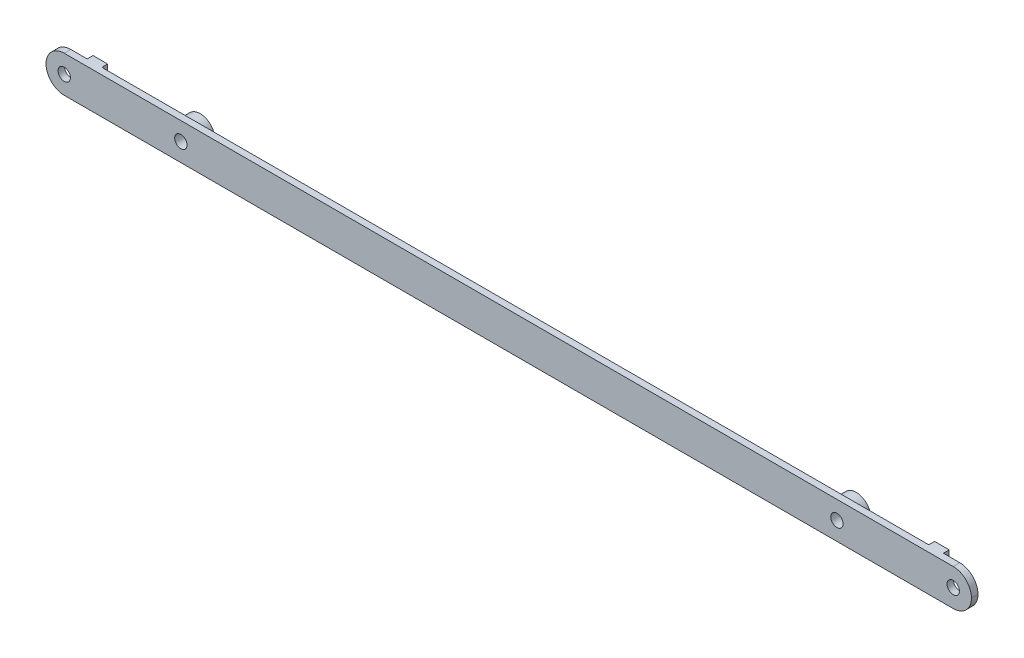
ISO-10303-21;
HEADER;
FILE_DESCRIPTION(('STEP AP214'),'2;1');
FILE_NAME('part.step','',(''),(''),'','','');
FILE_SCHEMA(('AUTOMOTIVE_DESIGN { 1 0 10303 214 1 1 1 1 }'));
ENDSEC;
DATA;
#1=APPLICATION_CONTEXT('core data for automotive mechanical design processes');
#2=APPLICATION_PROTOCOL_DEFINITION('international standard','automotive_design',2000,#1);
#3=PRODUCT_CONTEXT('',#1,'mechanical');
#4=PRODUCT('Part','Part','',(#3));
#5=PRODUCT_RELATED_PRODUCT_CATEGORY('part','',(#4));
#6=PRODUCT_DEFINITION_FORMATION('','',#4);
#7=PRODUCT_DEFINITION_CONTEXT('part definition',#1,'design');
#8=PRODUCT_DEFINITION('design','',#6,#7);
#9=PRODUCT_DEFINITION_SHAPE('','',#8);
#10=(LENGTH_UNIT() NAMED_UNIT(*) SI_UNIT(.MILLI.,.METRE.));
#11=(NAMED_UNIT(*) PLANE_ANGLE_UNIT() SI_UNIT($,.RADIAN.));
#12=(NAMED_UNIT(*) SI_UNIT($,.STERADIAN.) SOLID_ANGLE_UNIT());
#13=UNCERTAINTY_MEASURE_WITH_UNIT(LENGTH_MEASURE(1.E-05),#10,'distance_accuracy_value','');
#14=(GEOMETRIC_REPRESENTATION_CONTEXT(3) GLOBAL_UNCERTAINTY_ASSIGNED_CONTEXT((#13)) GLOBAL_UNIT_ASSIGNED_CONTEXT((#10,
#11,#12)) REPRESENTATION_CONTEXT('',''));
#15=CARTESIAN_POINT('',(0.,0.,0.));
#16=DIRECTION('',(0.,0.,1.));
#17=DIRECTION('',(1.,0.,0.));
#18=AXIS2_PLACEMENT_3D('',#15,#16,#17);
#19=CARTESIAN_POINT('',(0.,0.,0.));
#20=DIRECTION('',(0.,0.,-1.));
#21=DIRECTION('',(-1.,0.,0.));
#22=AXIS2_PLACEMENT_3D('',#19,#20,#21);
#23=PLANE('',#22);
#24=DIRECTION('',(0.,-1.,0.));
#25=VECTOR('',#24,1.);
#26=CARTESIAN_POINT('',(-87.2960224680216,4.27712700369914,0.));
#27=LINE('',#26,#25);
#28=CARTESIAN_POINT('',(-87.2960224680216,4.27712700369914,0.));
#29=VERTEX_POINT('',#28);
#30=CARTESIAN_POINT('',(-87.2960224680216,-5.72287299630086,0.));
#31=VERTEX_POINT('',#30);
#32=EDGE_CURVE('E172',#29,#31,#27,.T.);
#33=ORIENTED_EDGE('',*,*,#32,.T.);
#34=DIRECTION('',(1.,0.,0.));
#35=VECTOR('',#34,1.);
#36=CARTESIAN_POINT('',(-96.7960224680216,-5.72287299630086,0.));
#37=LINE('',#36,#35);
#38=CARTESIAN_POINT('',(-91.7960224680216,-5.72287299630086,0.));
#39=VERTEX_POINT('',#38);
#40=EDGE_CURVE('E152',#39,#31,#37,.T.);
#41=ORIENTED_EDGE('',*,*,#40,.F.);
#42=CARTESIAN_POINT('',(-91.7960224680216,-0.722872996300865,0.));
#43=DIRECTION('',(0.,0.,-1.));
#44=DIRECTION('',(-1.,0.,0.));
#45=AXIS2_PLACEMENT_3D('',#42,#43,#44);
#46=CIRCLE('',#45,5.);
#47=CARTESIAN_POINT('',(-96.7960224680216,-0.722872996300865,0.));
#48=VERTEX_POINT('',#47);
#49=EDGE_CURVE('E261',#39,#48,#46,.T.);
#50=ORIENTED_EDGE('',*,*,#49,.T.);
#51=CARTESIAN_POINT('',(-91.7960224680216,-0.722872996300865,0.));
#52=DIRECTION('',(0.,0.,-1.));
#53=DIRECTION('',(-1.,0.,0.));
#54=AXIS2_PLACEMENT_3D('',#51,#52,#53);
#55=CIRCLE('',#54,5.);
#56=CARTESIAN_POINT('',(-91.7960224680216,4.27712700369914,0.));
#57=VERTEX_POINT('',#56);
#58=EDGE_CURVE('E252',#48,#57,#55,.T.);
#59=ORIENTED_EDGE('',*,*,#58,.T.);
#60=DIRECTION('',(-1.,0.,0.));
#61=VECTOR('',#60,1.);
#62=CARTESIAN_POINT('',(-96.7960224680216,4.27712700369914,0.));
#63=LINE('',#62,#61);
#64=EDGE_CURVE('E254',#29,#57,#63,.T.);
#65=ORIENTED_EDGE('',*,*,#64,.F.);
#66=EDGE_LOOP('',(#33,#41,#50,#59,#65));
#67=FACE_BOUND('',#66,.T.);
#68=CARTESIAN_POINT('',(-91.7960224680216,-0.722872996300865,0.));
#69=DIRECTION('',(0.,0.,1.));
#70=DIRECTION('',(1.,0.,0.));
#71=AXIS2_PLACEMENT_3D('',#68,#69,#70);
#72=CIRCLE('',#71,1.69999999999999);
#73=CARTESIAN_POINT('',(-90.0960224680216,-0.722872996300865,0.));
#74=VERTEX_POINT('',#73);
#75=EDGE_CURVE('E234',#74,#74,#72,.T.);
#76=ORIENTED_EDGE('',*,*,#75,.T.);
#77=EDGE_LOOP('',(#76));
#78=FACE_BOUND('',#77,.T.);
#79=ADVANCED_FACE('F35',(#67,#78),#23,.T.);
#80=DIRECTION('',(0.,1.,0.));
#81=VECTOR('',#80,1.);
#82=CARTESIAN_POINT('',(147.603977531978,-5.72287299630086,0.));
#83=LINE('',#82,#81);
#84=CARTESIAN_POINT('',(147.603977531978,-5.72287299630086,0.));
#85=VERTEX_POINT('',#84);
#86=CARTESIAN_POINT('',(147.603977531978,4.27712700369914,0.));
#87=VERTEX_POINT('',#86);
#88=EDGE_CURVE('E179',#85,#87,#83,.T.);
#89=ORIENTED_EDGE('',*,*,#88,.T.);
#90=CARTESIAN_POINT('',(152.103977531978,4.27712700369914,0.));
#91=VERTEX_POINT('',#90);
#92=EDGE_CURVE('E249',#91,#87,#63,.T.);
#93=ORIENTED_EDGE('',*,*,#92,.F.);
#94=CARTESIAN_POINT('',(152.103977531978,-0.722872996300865,0.));
#95=DIRECTION('',(0.,0.,-1.));
#96=DIRECTION('',(-1.,0.,0.));
#97=AXIS2_PLACEMENT_3D('',#94,#95,#96);
#98=CIRCLE('',#97,5.);
#99=CARTESIAN_POINT('',(157.103977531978,-0.722872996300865,0.));
#100=VERTEX_POINT('',#99);
#101=EDGE_CURVE('E263',#91,#100,#98,.T.);
#102=ORIENTED_EDGE('',*,*,#101,.T.);
#103=CARTESIAN_POINT('',(152.103977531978,-0.722872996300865,0.));
#104=DIRECTION('',(0.,0.,-1.));
#105=DIRECTION('',(-1.,0.,0.));
#106=AXIS2_PLACEMENT_3D('',#103,#104,#105);
#107=CIRCLE('',#106,5.);
#108=CARTESIAN_POINT('',(152.103977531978,-5.72287299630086,0.));
#109=VERTEX_POINT('',#108);
#110=EDGE_CURVE('E265',#100,#109,#107,.T.);
#111=ORIENTED_EDGE('',*,*,#110,.T.);
#112=EDGE_CURVE('E242',#85,#109,#37,.T.);
#113=ORIENTED_EDGE('',*,*,#112,.F.);
#114=EDGE_LOOP('',(#89,#93,#102,#111,#113));
#115=FACE_BOUND('',#114,.T.);
#116=CARTESIAN_POINT('',(152.103977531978,-0.722872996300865,0.));
#117=DIRECTION('',(0.,0.,1.));
#118=DIRECTION('',(1.,0.,0.));
#119=AXIS2_PLACEMENT_3D('',#116,#117,#118);
#120=CIRCLE('',#119,1.70000000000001);
#121=CARTESIAN_POINT('',(153.803977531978,-0.722872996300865,0.));
#122=VERTEX_POINT('',#121);
#123=EDGE_CURVE('E235',#122,#122,#120,.T.);
#124=ORIENTED_EDGE('',*,*,#123,.T.);
#125=EDGE_LOOP('',(#124));
#126=FACE_BOUND('',#125,.T.);
#127=ADVANCED_FACE('F353',(#115,#126),#23,.T.);
#128=CARTESIAN_POINT('',(-59.7960224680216,-0.722872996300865,2.));
#129=DIRECTION('',(0.,0.,-1.));
#130=DIRECTION('',(-1.,0.,0.));
#131=AXIS2_PLACEMENT_3D('',#128,#129,#130);
#132=CYLINDRICAL_SURFACE('',#131,1.7);
#133=CARTESIAN_POINT('',(-59.7960224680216,-0.722872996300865,-2.04999999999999));
#134=DIRECTION('',(0.,0.,-1.));
#135=DIRECTION('',(-1.,0.,0.));
#136=AXIS2_PLACEMENT_3D('',#133,#134,#135);
#137=CIRCLE('',#136,1.69999999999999);
#138=CARTESIAN_POINT('',(-61.4960224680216,-0.722872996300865,-2.04999999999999));
#139=VERTEX_POINT('',#138);
#140=EDGE_CURVE('E209',#139,#139,#137,.T.);
#141=ORIENTED_EDGE('',*,*,#140,.T.);
#142=EDGE_LOOP('',(#141));
#143=FACE_BOUND('',#142,.T.);
#144=CARTESIAN_POINT('',(-59.7960224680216,-0.722872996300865,1.8));
#145=DIRECTION('',(0.,0.,-1.));
#146=DIRECTION('',(-1.,0.,0.));
#147=AXIS2_PLACEMENT_3D('',#144,#145,#146);
#148=CIRCLE('',#147,1.7);
#149=CARTESIAN_POINT('',(-61.4960224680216,-0.722872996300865,1.8));
#150=VERTEX_POINT('',#149);
#151=EDGE_CURVE('E227',#150,#150,#148,.F.);
#152=ORIENTED_EDGE('',*,*,#151,.T.);
#153=EDGE_LOOP('',(#152));
#154=FACE_BOUND('',#153,.T.);
#155=ADVANCED_FACE('F384',(#143,#154),#132,.F.);
#156=CARTESIAN_POINT('',(120.203977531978,-0.722872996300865,2.));
#157=DIRECTION('',(0.,0.,-1.));
#158=DIRECTION('',(-1.,0.,0.));
#159=AXIS2_PLACEMENT_3D('',#156,#157,#158);
#160=CYLINDRICAL_SURFACE('',#159,1.70000000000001);
#161=CARTESIAN_POINT('',(120.203977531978,-0.722872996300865,-2.04999999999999));
#162=DIRECTION('',(0.,0.,-1.));
#163=DIRECTION('',(-1.,0.,0.));
#164=AXIS2_PLACEMENT_3D('',#161,#162,#163);
#165=CIRCLE('',#164,1.69999999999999);
#166=CARTESIAN_POINT('',(118.503977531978,-0.722872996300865,-2.04999999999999));
#167=VERTEX_POINT('',#166);
#168=EDGE_CURVE('E215',#167,#167,#165,.T.);
#169=ORIENTED_EDGE('',*,*,#168,.T.);
#170=EDGE_LOOP('',(#169));
#171=FACE_BOUND('',#170,.T.);
#172=CARTESIAN_POINT('',(120.203977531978,-0.722872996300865,1.8));
#173=DIRECTION('',(0.,0.,-1.));
#174=DIRECTION('',(-1.,0.,0.));
#175=AXIS2_PLACEMENT_3D('',#172,#173,#174);
#176=CIRCLE('',#175,1.70000000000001);
#177=CARTESIAN_POINT('',(118.503977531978,-0.722872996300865,1.8));
#178=VERTEX_POINT('',#177);
#179=EDGE_CURVE('E224',#178,#178,#176,.F.);
#180=ORIENTED_EDGE('',*,*,#179,.T.);
#181=EDGE_LOOP('',(#180));
#182=FACE_BOUND('',#181,.T.);
#183=ADVANCED_FACE('F395',(#171,#182),#160,.F.);
#184=CARTESIAN_POINT('',(0.,0.,1.8));
#185=DIRECTION('',(0.,0.,-1.));
#186=DIRECTION('',(-1.,0.,0.));
#187=AXIS2_PLACEMENT_3D('',#184,#185,#186);
#188=PLANE('',#187);
#189=ORIENTED_EDGE('',*,*,#179,.F.);
#190=EDGE_LOOP('',(#189));
#191=FACE_BOUND('',#190,.T.);
#192=ORIENTED_EDGE('',*,*,#151,.F.);
#193=EDGE_LOOP('',(#192));
#194=FACE_BOUND('',#193,.T.);
#195=DIRECTION('',(1.,0.,0.));
#196=VECTOR('',#195,1.);
#197=CARTESIAN_POINT('',(-96.7960224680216,-5.72287299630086,1.8));
#198=LINE('',#197,#196);
#199=CARTESIAN_POINT('',(-91.7960224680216,-5.72287299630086,1.8));
#200=VERTEX_POINT('',#199);
#201=CARTESIAN_POINT('',(152.103977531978,-5.72287299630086,1.8));
#202=VERTEX_POINT('',#201);
#203=EDGE_CURVE('E245',#200,#202,#198,.T.);
#204=ORIENTED_EDGE('',*,*,#203,.T.);
#205=CARTESIAN_POINT('',(152.103977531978,-0.722872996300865,1.8));
#206=DIRECTION('',(0.,0.,-1.));
#207=DIRECTION('',(-1.,0.,0.));
#208=AXIS2_PLACEMENT_3D('',#205,#206,#207);
#209=CIRCLE('',#208,5.);
#210=CARTESIAN_POINT('',(157.103977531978,-0.722872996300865,1.8));
#211=VERTEX_POINT('',#210);
#212=EDGE_CURVE('E279',#202,#211,#209,.F.);
#213=ORIENTED_EDGE('',*,*,#212,.T.);
#214=CARTESIAN_POINT('',(152.103977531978,-0.722872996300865,1.8));
#215=DIRECTION('',(0.,0.,-1.));
#216=DIRECTION('',(-1.,0.,0.));
#217=AXIS2_PLACEMENT_3D('',#214,#215,#216);
#218=CIRCLE('',#217,5.);
#219=CARTESIAN_POINT('',(152.103977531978,4.27712700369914,1.8));
#220=VERTEX_POINT('',#219);
#221=EDGE_CURVE('E277',#211,#220,#218,.F.);
#222=ORIENTED_EDGE('',*,*,#221,.T.);
#223=DIRECTION('',(-1.,0.,0.));
#224=VECTOR('',#223,1.);
#225=CARTESIAN_POINT('',(-96.7960224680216,4.27712700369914,1.8));
#226=LINE('',#225,#224);
#227=CARTESIAN_POINT('',(-91.7960224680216,4.27712700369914,1.8));
#228=VERTEX_POINT('',#227);
#229=EDGE_CURVE('E248',#220,#228,#226,.T.);
#230=ORIENTED_EDGE('',*,*,#229,.T.);
#231=CARTESIAN_POINT('',(-91.7960224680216,-0.722872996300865,1.8));
#232=DIRECTION('',(0.,0.,-1.));
#233=DIRECTION('',(-1.,0.,0.));
#234=AXIS2_PLACEMENT_3D('',#231,#232,#233);
#235=CIRCLE('',#234,5.);
#236=CARTESIAN_POINT('',(-96.7960224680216,-0.722872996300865,1.8));
#237=VERTEX_POINT('',#236);
#238=EDGE_CURVE('E273',#228,#237,#235,.F.);
#239=ORIENTED_EDGE('',*,*,#238,.T.);
#240=CARTESIAN_POINT('',(-91.7960224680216,-0.722872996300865,1.8));
#241=DIRECTION('',(0.,0.,-1.));
#242=DIRECTION('',(-1.,0.,0.));
#243=AXIS2_PLACEMENT_3D('',#240,#241,#242);
#244=CIRCLE('',#243,5.);
#245=EDGE_CURVE('E275',#237,#200,#244,.F.);
#246=ORIENTED_EDGE('',*,*,#245,.T.);
#247=EDGE_LOOP('',(#204,#213,#222,#230,#239,#246));
#248=FACE_BOUND('',#247,.T.);
#249=CARTESIAN_POINT('',(-91.7960224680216,-0.722872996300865,1.8));
#250=DIRECTION('',(0.,0.,1.));
#251=DIRECTION('',(1.,0.,0.));
#252=AXIS2_PLACEMENT_3D('',#249,#250,#251);
#253=CIRCLE('',#252,1.69999999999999);
#254=CARTESIAN_POINT('',(-90.0960224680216,-0.722872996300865,1.8));
#255=VERTEX_POINT('',#254);
#256=EDGE_CURVE('E239',#255,#255,#253,.T.);
#257=ORIENTED_EDGE('',*,*,#256,.F.);
#258=EDGE_LOOP('',(#257));
#259=FACE_BOUND('',#258,.T.);
#260=CARTESIAN_POINT('',(152.103977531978,-0.722872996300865,1.8));
#261=DIRECTION('',(0.,0.,1.));
#262=DIRECTION('',(1.,0.,0.));
#263=AXIS2_PLACEMENT_3D('',#260,#261,#262);
#264=CIRCLE('',#263,1.70000000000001);
#265=CARTESIAN_POINT('',(153.803977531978,-0.722872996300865,1.8));
#266=VERTEX_POINT('',#265);
#267=EDGE_CURVE('E231',#266,#266,#264,.T.);
#268=ORIENTED_EDGE('',*,*,#267,.F.);
#269=EDGE_LOOP('',(#268));
#270=FACE_BOUND('',#269,.T.);
#271=ADVANCED_FACE('F340',(#191,#194,#248,#259,#270),#188,.F.);
#272=CARTESIAN_POINT('',(120.203977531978,-0.722872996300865,0.));
#273=DIRECTION('',(0.,0.,-1.));
#274=DIRECTION('',(-1.,0.,0.));
#275=AXIS2_PLACEMENT_3D('',#272,#273,#274);
#276=CIRCLE('',#275,4.40000000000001);
#277=CARTESIAN_POINT('',(115.803977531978,-0.722872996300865,0.));
#278=VERTEX_POINT('',#277);
#279=EDGE_CURVE('E295',#278,#278,#276,.F.);
#280=ORIENTED_EDGE('',*,*,#279,.T.);
#281=EDGE_LOOP('',(#280));
#282=FACE_BOUND('',#281,.T.);
#283=CARTESIAN_POINT('',(-59.7960224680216,-0.722872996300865,0.));
#284=DIRECTION('',(0.,0.,-1.));
#285=DIRECTION('',(-1.,0.,0.));
#286=AXIS2_PLACEMENT_3D('',#283,#284,#285);
#287=CIRCLE('',#286,4.40000000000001);
#288=CARTESIAN_POINT('',(-64.1960224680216,-0.722872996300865,0.));
#289=VERTEX_POINT('',#288);
#290=EDGE_CURVE('E285',#289,#289,#287,.F.);
#291=ORIENTED_EDGE('',*,*,#290,.T.);
#292=EDGE_LOOP('',(#291));
#293=FACE_BOUND('',#292,.T.);
#294=CARTESIAN_POINT('',(-82.8960224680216,-5.72287299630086,0.));
#295=VERTEX_POINT('',#294);
#296=CARTESIAN_POINT('',(143.203977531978,-5.72287299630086,0.));
#297=VERTEX_POINT('',#296);
#298=EDGE_CURVE('E255',#295,#297,#37,.T.);
#299=ORIENTED_EDGE('',*,*,#298,.F.);
#300=DIRECTION('',(0.,1.,0.));
#301=VECTOR('',#300,1.);
#302=CARTESIAN_POINT('',(-82.8960224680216,4.27712700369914,0.));
#303=LINE('',#302,#301);
#304=CARTESIAN_POINT('',(-82.8960224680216,4.27712700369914,0.));
#305=VERTEX_POINT('',#304);
#306=EDGE_CURVE('E298',#295,#305,#303,.T.);
#307=ORIENTED_EDGE('',*,*,#306,.T.);
#308=CARTESIAN_POINT('',(143.203977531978,4.27712700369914,0.));
#309=VERTEX_POINT('',#308);
#310=EDGE_CURVE('E258',#309,#305,#63,.T.);
#311=ORIENTED_EDGE('',*,*,#310,.F.);
#312=DIRECTION('',(0.,-1.,0.));
#313=VECTOR('',#312,1.);
#314=CARTESIAN_POINT('',(143.203977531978,-5.72287299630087,0.));
#315=LINE('',#314,#313);
#316=EDGE_CURVE('E292',#309,#297,#315,.T.);
#317=ORIENTED_EDGE('',*,*,#316,.T.);
#318=EDGE_LOOP('',(#299,#307,#311,#317));
#319=FACE_BOUND('',#318,.T.);
#320=ADVANCED_FACE('F319',(#282,#293,#319),#23,.T.);
#321=CARTESIAN_POINT('',(-96.7960224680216,-5.72287299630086,1.8));
#322=DIRECTION('',(0.,1.,0.));
#323=DIRECTION('',(0.,0.,1.));
#324=AXIS2_PLACEMENT_3D('',#321,#322,#323);
#325=PLANE('',#324);
#326=ORIENTED_EDGE('',*,*,#40,.T.);
#327=DIRECTION('',(0.,0.,1.));
#328=VECTOR('',#327,1.);
#329=CARTESIAN_POINT('',(-87.2960224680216,-5.72287299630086,-1.6));
#330=LINE('',#329,#328);
#331=CARTESIAN_POINT('',(-87.2960224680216,-5.72287299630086,-1.6));
#332=VERTEX_POINT('',#331);
#333=EDGE_CURVE('E145',#332,#31,#330,.T.);
#334=ORIENTED_EDGE('',*,*,#333,.F.);
#335=DIRECTION('',(1.,0.,0.));
#336=VECTOR('',#335,1.);
#337=CARTESIAN_POINT('',(-87.2960224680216,-5.72287299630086,-1.6));
#338=LINE('',#337,#336);
#339=CARTESIAN_POINT('',(-83.2960224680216,-5.72287299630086,-1.6));
#340=VERTEX_POINT('',#339);
#341=EDGE_CURVE('E149',#332,#340,#338,.T.);
#342=ORIENTED_EDGE('',*,*,#341,.T.);
#343=DIRECTION('',(0.,0.,1.));
#344=VECTOR('',#343,1.);
#345=CARTESIAN_POINT('',(-83.2960224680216,-5.72287299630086,-1.6));
#346=LINE('',#345,#344);
#347=CARTESIAN_POINT('',(-83.2960224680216,-5.72287299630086,-0.4));
#348=VERTEX_POINT('',#347);
#349=EDGE_CURVE('E156',#340,#348,#346,.T.);
#350=ORIENTED_EDGE('',*,*,#349,.T.);
#351=CARTESIAN_POINT('',(-82.8960224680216,-5.72287299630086,-0.4));
#352=DIRECTION('',(0.,1.,0.));
#353=DIRECTION('',(0.,0.,1.));
#354=AXIS2_PLACEMENT_3D('',#351,#352,#353);
#355=CIRCLE('',#354,0.4);
#356=EDGE_CURVE('E312',#348,#295,#355,.T.);
#357=ORIENTED_EDGE('',*,*,#356,.T.);
#358=ORIENTED_EDGE('',*,*,#298,.T.);
#359=CARTESIAN_POINT('',(143.203977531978,-5.72287299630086,-0.4));
#360=DIRECTION('',(0.,1.,0.));
#361=DIRECTION('',(0.,0.,1.));
#362=AXIS2_PLACEMENT_3D('',#359,#360,#361);
#363=CIRCLE('',#362,0.4);
#364=CARTESIAN_POINT('',(143.603977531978,-5.72287299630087,-0.4));
#365=VERTEX_POINT('',#364);
#366=EDGE_CURVE('E43',#297,#365,#363,.T.);
#367=ORIENTED_EDGE('',*,*,#366,.T.);
#368=DIRECTION('',(0.,0.,1.));
#369=VECTOR('',#368,1.);
#370=CARTESIAN_POINT('',(143.603977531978,-5.72287299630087,-1.6));
#371=LINE('',#370,#369);
#372=CARTESIAN_POINT('',(143.603977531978,-5.72287299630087,-1.6));
#373=VERTEX_POINT('',#372);
#374=EDGE_CURVE('E202',#373,#365,#371,.T.);
#375=ORIENTED_EDGE('',*,*,#374,.F.);
#376=DIRECTION('',(1.,0.,0.));
#377=VECTOR('',#376,1.);
#378=CARTESIAN_POINT('',(147.603977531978,-5.72287299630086,-1.6));
#379=LINE('',#378,#377);
#380=CARTESIAN_POINT('',(147.603977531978,-5.72287299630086,-1.6));
#381=VERTEX_POINT('',#380);
#382=EDGE_CURVE('E193',#373,#381,#379,.T.);
#383=ORIENTED_EDGE('',*,*,#382,.T.);
#384=DIRECTION('',(0.,0.,1.));
#385=VECTOR('',#384,1.);
#386=CARTESIAN_POINT('',(147.603977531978,-5.72287299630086,-1.6));
#387=LINE('',#386,#385);
#388=EDGE_CURVE('E199',#381,#85,#387,.T.);
#389=ORIENTED_EDGE('',*,*,#388,.T.);
#390=ORIENTED_EDGE('',*,*,#112,.T.);
#391=DIRECTION('',(0.,0.,-1.));
#392=VECTOR('',#391,1.);
#393=CARTESIAN_POINT('',(152.103977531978,-5.72287299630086,1.8));
#394=LINE('',#393,#392);
#395=EDGE_CURVE('E270',#109,#202,#394,.F.);
#396=ORIENTED_EDGE('',*,*,#395,.T.);
#397=ORIENTED_EDGE('',*,*,#203,.F.);
#398=DIRECTION('',(0.,0.,-1.));
#399=VECTOR('',#398,1.);
#400=CARTESIAN_POINT('',(-91.7960224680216,-5.72287299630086,1.8));
#401=LINE('',#400,#399);
#402=EDGE_CURVE('E268',#200,#39,#401,.T.);
#403=ORIENTED_EDGE('',*,*,#402,.T.);
#404=EDGE_LOOP('',(#326,#334,#342,#350,#357,#358,#367,#375,#383,#389,#390,#396,#397,#403));
#405=FACE_BOUND('',#404,.T.);
#406=ADVANCED_FACE('F147',(#405),#325,.F.);
#407=CARTESIAN_POINT('',(-96.7960224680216,4.27712700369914,1.8));
#408=DIRECTION('',(0.,-1.,0.));
#409=DIRECTION('',(0.,0.,-1.));
#410=AXIS2_PLACEMENT_3D('',#407,#408,#409);
#411=PLANE('',#410);
#412=ORIENTED_EDGE('',*,*,#229,.F.);
#413=DIRECTION('',(0.,0.,-1.));
#414=VECTOR('',#413,1.);
#415=CARTESIAN_POINT('',(152.103977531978,4.27712700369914,1.8));
#416=LINE('',#415,#414);
#417=EDGE_CURVE('E283',#220,#91,#416,.T.);
#418=ORIENTED_EDGE('',*,*,#417,.T.);
#419=ORIENTED_EDGE('',*,*,#92,.T.);
#420=DIRECTION('',(0.,0.,1.));
#421=VECTOR('',#420,1.);
#422=CARTESIAN_POINT('',(147.603977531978,4.27712700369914,-1.6));
#423=LINE('',#422,#421);
#424=CARTESIAN_POINT('',(147.603977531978,4.27712700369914,-1.6));
#425=VERTEX_POINT('',#424);
#426=EDGE_CURVE('E196',#425,#87,#423,.T.);
#427=ORIENTED_EDGE('',*,*,#426,.F.);
#428=DIRECTION('',(-1.,0.,0.));
#429=VECTOR('',#428,1.);
#430=CARTESIAN_POINT('',(147.603977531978,4.27712700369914,-1.6));
#431=LINE('',#430,#429);
#432=CARTESIAN_POINT('',(143.603977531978,4.27712700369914,-1.6));
#433=VERTEX_POINT('',#432);
#434=EDGE_CURVE('E187',#425,#433,#431,.T.);
#435=ORIENTED_EDGE('',*,*,#434,.T.);
#436=DIRECTION('',(0.,0.,1.));
#437=VECTOR('',#436,1.);
#438=CARTESIAN_POINT('',(143.603977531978,4.27712700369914,-1.6));
#439=LINE('',#438,#437);
#440=CARTESIAN_POINT('',(143.603977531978,4.27712700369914,-0.4));
#441=VERTEX_POINT('',#440);
#442=EDGE_CURVE('E204',#433,#441,#439,.T.);
#443=ORIENTED_EDGE('',*,*,#442,.T.);
#444=CARTESIAN_POINT('',(143.203977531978,4.27712700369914,-0.4));
#445=DIRECTION('',(0.,-1.,0.));
#446=DIRECTION('',(0.,0.,-1.));
#447=AXIS2_PLACEMENT_3D('',#444,#445,#446);
#448=CIRCLE('',#447,0.4);
#449=EDGE_CURVE('E11',#441,#309,#448,.T.);
#450=ORIENTED_EDGE('',*,*,#449,.T.);
#451=ORIENTED_EDGE('',*,*,#310,.T.);
#452=CARTESIAN_POINT('',(-82.8960224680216,4.27712700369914,-0.4));
#453=DIRECTION('',(0.,-1.,0.));
#454=DIRECTION('',(0.,0.,-1.));
#455=AXIS2_PLACEMENT_3D('',#452,#453,#454);
#456=CIRCLE('',#455,0.4);
#457=CARTESIAN_POINT('',(-83.2960224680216,4.27712700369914,-0.4));
#458=VERTEX_POINT('',#457);
#459=EDGE_CURVE('E310',#305,#458,#456,.T.);
#460=ORIENTED_EDGE('',*,*,#459,.T.);
#461=DIRECTION('',(0.,0.,1.));
#462=VECTOR('',#461,1.);
#463=CARTESIAN_POINT('',(-83.2960224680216,4.27712700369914,-1.6));
#464=LINE('',#463,#462);
#465=CARTESIAN_POINT('',(-83.2960224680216,4.27712700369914,-1.6));
#466=VERTEX_POINT('',#465);
#467=EDGE_CURVE('E180',#466,#458,#464,.T.);
#468=ORIENTED_EDGE('',*,*,#467,.F.);
#469=DIRECTION('',(-1.,0.,0.));
#470=VECTOR('',#469,1.);
#471=CARTESIAN_POINT('',(-87.2960224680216,4.27712700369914,-1.6));
#472=LINE('',#471,#470);
#473=CARTESIAN_POINT('',(-87.2960224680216,4.27712700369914,-1.6));
#474=VERTEX_POINT('',#473);
#475=EDGE_CURVE('E157',#466,#474,#472,.T.);
#476=ORIENTED_EDGE('',*,*,#475,.T.);
#477=DIRECTION('',(0.,0.,1.));
#478=VECTOR('',#477,1.);
#479=CARTESIAN_POINT('',(-87.2960224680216,4.27712700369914,-1.6));
#480=LINE('',#479,#478);
#481=EDGE_CURVE('E171',#474,#29,#480,.T.);
#482=ORIENTED_EDGE('',*,*,#481,.T.);
#483=ORIENTED_EDGE('',*,*,#64,.T.);
#484=DIRECTION('',(0.,0.,-1.));
#485=VECTOR('',#484,1.);
#486=CARTESIAN_POINT('',(-91.7960224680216,4.27712700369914,1.8));
#487=LINE('',#486,#485);
#488=EDGE_CURVE('E281',#57,#228,#487,.F.);
#489=ORIENTED_EDGE('',*,*,#488,.T.);
#490=EDGE_LOOP('',(#412,#418,#419,#427,#435,#443,#450,#451,#460,#468,#476,#482,#483,#489));
#491=FACE_BOUND('',#490,.T.);
#492=ADVANCED_FACE('F326',(#491),#411,.F.);
#493=CARTESIAN_POINT('',(-91.7960224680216,-0.722872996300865,1.8));
#494=DIRECTION('',(0.,0.,-1.));
#495=DIRECTION('',(-1.,0.,0.));
#496=AXIS2_PLACEMENT_3D('',#493,#494,#495);
#497=CYLINDRICAL_SURFACE('',#496,1.69999999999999);
#498=ORIENTED_EDGE('',*,*,#256,.T.);
#499=EDGE_LOOP('',(#498));
#500=FACE_BOUND('',#499,.T.);
#501=ORIENTED_EDGE('',*,*,#75,.F.);
#502=EDGE_LOOP('',(#501));
#503=FACE_BOUND('',#502,.T.);
#504=ADVANCED_FACE('F435',(#500,#503),#497,.F.);
#505=CARTESIAN_POINT('',(152.103977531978,-0.722872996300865,1.8));
#506=DIRECTION('',(0.,0.,-1.));
#507=DIRECTION('',(-1.,0.,0.));
#508=AXIS2_PLACEMENT_3D('',#505,#506,#507);
#509=CYLINDRICAL_SURFACE('',#508,1.70000000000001);
#510=ORIENTED_EDGE('',*,*,#267,.T.);
#511=EDGE_LOOP('',(#510));
#512=FACE_BOUND('',#511,.T.);
#513=ORIENTED_EDGE('',*,*,#123,.F.);
#514=EDGE_LOOP('',(#513));
#515=FACE_BOUND('',#514,.T.);
#516=ADVANCED_FACE('F432',(#512,#515),#509,.F.);
#517=CARTESIAN_POINT('',(152.103977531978,-0.722872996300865,1.8));
#518=DIRECTION('',(0.,0.,-1.));
#519=DIRECTION('',(-1.,0.,0.));
#520=AXIS2_PLACEMENT_3D('',#517,#518,#519);
#521=CYLINDRICAL_SURFACE('',#520,5.);
#522=ORIENTED_EDGE('',*,*,#417,.F.);
#523=ORIENTED_EDGE('',*,*,#221,.F.);
#524=DIRECTION('',(0.,0.,-1.));
#525=VECTOR('',#524,1.);
#526=CARTESIAN_POINT('',(157.103977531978,-0.722872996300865,1.8));
#527=LINE('',#526,#525);
#528=EDGE_CURVE('E238',#100,#211,#527,.F.);
#529=ORIENTED_EDGE('',*,*,#528,.F.);
#530=ORIENTED_EDGE('',*,*,#101,.F.);
#531=EDGE_LOOP('',(#522,#523,#529,#530));
#532=FACE_BOUND('',#531,.T.);
#533=ADVANCED_FACE('F345',(#532),#521,.T.);
#534=CARTESIAN_POINT('',(152.103977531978,-0.722872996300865,1.8));
#535=DIRECTION('',(0.,0.,-1.));
#536=DIRECTION('',(-1.,0.,0.));
#537=AXIS2_PLACEMENT_3D('',#534,#535,#536);
#538=CYLINDRICAL_SURFACE('',#537,5.);
#539=ORIENTED_EDGE('',*,*,#212,.F.);
#540=ORIENTED_EDGE('',*,*,#395,.F.);
#541=ORIENTED_EDGE('',*,*,#110,.F.);
#542=ORIENTED_EDGE('',*,*,#528,.T.);
#543=EDGE_LOOP('',(#539,#540,#541,#542));
#544=FACE_BOUND('',#543,.T.);
#545=ADVANCED_FACE('F349',(#544),#538,.T.);
#546=CARTESIAN_POINT('',(-91.7960224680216,-0.722872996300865,1.8));
#547=DIRECTION('',(0.,0.,-1.));
#548=DIRECTION('',(-1.,0.,0.));
#549=AXIS2_PLACEMENT_3D('',#546,#547,#548);
#550=CYLINDRICAL_SURFACE('',#549,5.);
#551=DIRECTION('',(0.,0.,-1.));
#552=VECTOR('',#551,1.);
#553=CARTESIAN_POINT('',(-96.7960224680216,-0.722872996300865,1.8));
#554=LINE('',#553,#552);
#555=EDGE_CURVE('E230',#237,#48,#554,.T.);
#556=ORIENTED_EDGE('',*,*,#555,.F.);
#557=ORIENTED_EDGE('',*,*,#238,.F.);
#558=ORIENTED_EDGE('',*,*,#488,.F.);
#559=ORIENTED_EDGE('',*,*,#58,.F.);
#560=EDGE_LOOP('',(#556,#557,#558,#559));
#561=FACE_BOUND('',#560,.T.);
#562=ADVANCED_FACE('F337',(#561),#550,.T.);
#563=CARTESIAN_POINT('',(-91.7960224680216,-0.722872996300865,1.8));
#564=DIRECTION('',(0.,0.,-1.));
#565=DIRECTION('',(-1.,0.,0.));
#566=AXIS2_PLACEMENT_3D('',#563,#564,#565);
#567=CYLINDRICAL_SURFACE('',#566,5.);
#568=ORIENTED_EDGE('',*,*,#245,.F.);
#569=ORIENTED_EDGE('',*,*,#555,.T.);
#570=ORIENTED_EDGE('',*,*,#49,.F.);
#571=ORIENTED_EDGE('',*,*,#402,.F.);
#572=EDGE_LOOP('',(#568,#569,#570,#571));
#573=FACE_BOUND('',#572,.T.);
#574=ADVANCED_FACE('F407',(#573),#567,.T.);
#575=CARTESIAN_POINT('',(-59.7960224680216,-0.722872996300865,-3.5));
#576=DIRECTION('',(0.,0.,1.));
#577=DIRECTION('',(1.,0.,0.));
#578=AXIS2_PLACEMENT_3D('',#575,#576,#577);
#579=CYLINDRICAL_SURFACE('',#578,4.00000000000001);
#580=CARTESIAN_POINT('',(-59.7960224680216,-0.722872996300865,-0.4));
#581=DIRECTION('',(0.,0.,-1.));
#582=DIRECTION('',(-1.,0.,0.));
#583=AXIS2_PLACEMENT_3D('',#580,#581,#582);
#584=CIRCLE('',#583,4.00000000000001);
#585=CARTESIAN_POINT('',(-63.7960224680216,-0.722872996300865,-0.4));
#586=VERTEX_POINT('',#585);
#587=EDGE_CURVE('E307',#586,#586,#584,.T.);
#588=ORIENTED_EDGE('',*,*,#587,.T.);
#589=EDGE_LOOP('',(#588));
#590=FACE_BOUND('',#589,.T.);
#591=CARTESIAN_POINT('',(-59.7960224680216,-0.722872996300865,-3.5));
#592=DIRECTION('',(0.,0.,1.));
#593=DIRECTION('',(1.,0.,0.));
#594=AXIS2_PLACEMENT_3D('',#591,#592,#593);
#595=CIRCLE('',#594,4.00000000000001);
#596=CARTESIAN_POINT('',(-55.7960224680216,-0.722872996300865,-3.5));
#597=VERTEX_POINT('',#596);
#598=EDGE_CURVE('E221',#597,#597,#595,.T.);
#599=ORIENTED_EDGE('',*,*,#598,.T.);
#600=EDGE_LOOP('',(#599));
#601=FACE_BOUND('',#600,.T.);
#602=ADVANCED_FACE('F403',(#590,#601),#579,.T.);
#603=CARTESIAN_POINT('',(-59.7960224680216,-0.722872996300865,-3.5));
#604=DIRECTION('',(0.,0.,1.));
#605=DIRECTION('',(1.,0.,0.));
#606=AXIS2_PLACEMENT_3D('',#603,#604,#605);
#607=PLANE('',#606);
#608=CARTESIAN_POINT('',(-59.7960224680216,-0.722872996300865,-3.5));
#609=DIRECTION('',(0.,0.,-1.));
#610=DIRECTION('',(-1.,0.,0.));
#611=AXIS2_PLACEMENT_3D('',#608,#609,#610);
#612=CIRCLE('',#611,3.15);
#613=CARTESIAN_POINT('',(-62.9460224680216,-0.722872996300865,-3.5));
#614=VERTEX_POINT('',#613);
#615=EDGE_CURVE('E201',#614,#614,#612,.T.);
#616=ORIENTED_EDGE('',*,*,#615,.F.);
#617=EDGE_LOOP('',(#616));
#618=FACE_BOUND('',#617,.T.);
#619=ORIENTED_EDGE('',*,*,#598,.F.);
#620=EDGE_LOOP('',(#619));
#621=FACE_BOUND('',#620,.T.);
#622=ADVANCED_FACE('F406',(#618,#621),#607,.F.);
#623=CARTESIAN_POINT('',(120.203977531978,-0.722872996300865,-3.5));
#624=DIRECTION('',(0.,0.,1.));
#625=DIRECTION('',(1.,0.,0.));
#626=AXIS2_PLACEMENT_3D('',#623,#624,#625);
#627=CYLINDRICAL_SURFACE('',#626,4.00000000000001);
#628=CARTESIAN_POINT('',(120.203977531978,-0.722872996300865,-0.4));
#629=DIRECTION('',(0.,0.,-1.));
#630=DIRECTION('',(-1.,0.,0.));
#631=AXIS2_PLACEMENT_3D('',#628,#629,#630);
#632=CIRCLE('',#631,4.00000000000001);
#633=CARTESIAN_POINT('',(116.203977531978,-0.722872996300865,-0.4));
#634=VERTEX_POINT('',#633);
#635=EDGE_CURVE('E303',#634,#634,#632,.T.);
#636=ORIENTED_EDGE('',*,*,#635,.T.);
#637=EDGE_LOOP('',(#636));
#638=FACE_BOUND('',#637,.T.);
#639=CARTESIAN_POINT('',(120.203977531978,-0.722872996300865,-3.5));
#640=DIRECTION('',(0.,0.,1.));
#641=DIRECTION('',(1.,0.,0.));
#642=AXIS2_PLACEMENT_3D('',#639,#640,#641);
#643=CIRCLE('',#642,4.00000000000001);
#644=CARTESIAN_POINT('',(124.203977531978,-0.722872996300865,-3.5));
#645=VERTEX_POINT('',#644);
#646=EDGE_CURVE('E218',#645,#645,#643,.T.);
#647=ORIENTED_EDGE('',*,*,#646,.T.);
#648=EDGE_LOOP('',(#647));
#649=FACE_BOUND('',#648,.T.);
#650=ADVANCED_FACE('F412',(#638,#649),#627,.T.);
#651=CARTESIAN_POINT('',(120.203977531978,-0.722872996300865,-3.5));
#652=DIRECTION('',(0.,0.,1.));
#653=DIRECTION('',(1.,0.,0.));
#654=AXIS2_PLACEMENT_3D('',#651,#652,#653);
#655=PLANE('',#654);
#656=CARTESIAN_POINT('',(120.203977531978,-0.722872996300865,-3.5));
#657=DIRECTION('',(0.,0.,-1.));
#658=DIRECTION('',(-1.,0.,0.));
#659=AXIS2_PLACEMENT_3D('',#656,#657,#658);
#660=CIRCLE('',#659,3.15);
#661=CARTESIAN_POINT('',(117.053977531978,-0.722872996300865,-3.5));
#662=VERTEX_POINT('',#661);
#663=EDGE_CURVE('E212',#662,#662,#660,.T.);
#664=ORIENTED_EDGE('',*,*,#663,.F.);
#665=EDGE_LOOP('',(#664));
#666=FACE_BOUND('',#665,.T.);
#667=ORIENTED_EDGE('',*,*,#646,.F.);
#668=EDGE_LOOP('',(#667));
#669=FACE_BOUND('',#668,.T.);
#670=ADVANCED_FACE('F420',(#666,#669),#655,.F.);
#671=CARTESIAN_POINT('',(120.203977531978,-0.722872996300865,-3.5));
#672=DIRECTION('',(0.,0.,-1.));
#673=DIRECTION('',(-1.,0.,0.));
#674=AXIS2_PLACEMENT_3D('',#671,#672,#673);
#675=CONICAL_SURFACE('',#674,3.15,0.785398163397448);
#676=ORIENTED_EDGE('',*,*,#168,.F.);
#677=EDGE_LOOP('',(#676));
#678=FACE_BOUND('',#677,.T.);
#679=ORIENTED_EDGE('',*,*,#663,.T.);
#680=EDGE_LOOP('',(#679));
#681=FACE_BOUND('',#680,.T.);
#682=ADVANCED_FACE('F482',(#678,#681),#675,.F.);
#683=CARTESIAN_POINT('',(-59.7960224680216,-0.722872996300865,-3.5));
#684=DIRECTION('',(0.,0.,-1.));
#685=DIRECTION('',(-1.,0.,0.));
#686=AXIS2_PLACEMENT_3D('',#683,#684,#685);
#687=CONICAL_SURFACE('',#686,3.15,0.78539816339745);
#688=ORIENTED_EDGE('',*,*,#140,.F.);
#689=EDGE_LOOP('',(#688));
#690=FACE_BOUND('',#689,.T.);
#691=ORIENTED_EDGE('',*,*,#615,.T.);
#692=EDGE_LOOP('',(#691));
#693=FACE_BOUND('',#692,.T.);
#694=ADVANCED_FACE('F479',(#690,#693),#687,.F.);
#695=CARTESIAN_POINT('',(147.603977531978,-5.72287299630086,-1.6));
#696=DIRECTION('',(1.,0.,0.));
#697=DIRECTION('',(0.,0.,-1.));
#698=AXIS2_PLACEMENT_3D('',#695,#696,#697);
#699=PLANE('',#698);
#700=ORIENTED_EDGE('',*,*,#88,.F.);
#701=ORIENTED_EDGE('',*,*,#388,.F.);
#702=DIRECTION('',(0.,1.,0.));
#703=VECTOR('',#702,1.);
#704=CARTESIAN_POINT('',(147.603977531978,-5.72287299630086,-1.6));
#705=LINE('',#704,#703);
#706=EDGE_CURVE('E184',#381,#425,#705,.T.);
#707=ORIENTED_EDGE('',*,*,#706,.T.);
#708=ORIENTED_EDGE('',*,*,#426,.T.);
#709=EDGE_LOOP('',(#700,#701,#707,#708));
#710=FACE_BOUND('',#709,.T.);
#711=ADVANCED_FACE('F364',(#710),#699,.T.);
#712=CARTESIAN_POINT('',(143.603977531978,-5.72287299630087,-1.6));
#713=DIRECTION('',(-1.,0.,0.));
#714=DIRECTION('',(0.,0.,1.));
#715=AXIS2_PLACEMENT_3D('',#712,#713,#714);
#716=PLANE('',#715);
#717=ORIENTED_EDGE('',*,*,#374,.T.);
#718=DIRECTION('',(0.,-1.,0.));
#719=VECTOR('',#718,1.);
#720=CARTESIAN_POINT('',(143.603977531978,4.27712700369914,-0.4));
#721=LINE('',#720,#719);
#722=EDGE_CURVE('E56',#365,#441,#721,.F.);
#723=ORIENTED_EDGE('',*,*,#722,.T.);
#724=ORIENTED_EDGE('',*,*,#442,.F.);
#725=DIRECTION('',(0.,-1.,0.));
#726=VECTOR('',#725,1.);
#727=CARTESIAN_POINT('',(143.603977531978,-5.72287299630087,-1.6));
#728=LINE('',#727,#726);
#729=EDGE_CURVE('E190',#433,#373,#728,.T.);
#730=ORIENTED_EDGE('',*,*,#729,.T.);
#731=EDGE_LOOP('',(#717,#723,#724,#730));
#732=FACE_BOUND('',#731,.T.);
#733=ADVANCED_FACE('F365',(#732),#716,.T.);
#734=CARTESIAN_POINT('',(0.,0.,-1.6));
#735=DIRECTION('',(0.,0.,1.));
#736=DIRECTION('',(1.,0.,0.));
#737=AXIS2_PLACEMENT_3D('',#734,#735,#736);
#738=PLANE('',#737);
#739=ORIENTED_EDGE('',*,*,#706,.F.);
#740=ORIENTED_EDGE('',*,*,#382,.F.);
#741=ORIENTED_EDGE('',*,*,#729,.F.);
#742=ORIENTED_EDGE('',*,*,#434,.F.);
#743=EDGE_LOOP('',(#739,#740,#741,#742));
#744=FACE_BOUND('',#743,.T.);
#745=ADVANCED_FACE('F362',(#744),#738,.F.);
#746=CARTESIAN_POINT('',(-87.2960224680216,4.27712700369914,-1.6));
#747=DIRECTION('',(-1.,0.,0.));
#748=DIRECTION('',(0.,0.,1.));
#749=AXIS2_PLACEMENT_3D('',#746,#747,#748);
#750=PLANE('',#749);
#751=ORIENTED_EDGE('',*,*,#32,.F.);
#752=ORIENTED_EDGE('',*,*,#481,.F.);
#753=DIRECTION('',(0.,-1.,0.));
#754=VECTOR('',#753,1.);
#755=CARTESIAN_POINT('',(-87.2960224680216,4.27712700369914,-1.6));
#756=LINE('',#755,#754);
#757=EDGE_CURVE('E164',#474,#332,#756,.T.);
#758=ORIENTED_EDGE('',*,*,#757,.T.);
#759=ORIENTED_EDGE('',*,*,#333,.T.);
#760=EDGE_LOOP('',(#751,#752,#758,#759));
#761=FACE_BOUND('',#760,.T.);
#762=ADVANCED_FACE('F169',(#761),#750,.T.);
#763=CARTESIAN_POINT('',(-83.2960224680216,4.27712700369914,-1.6));
#764=DIRECTION('',(1.,0.,0.));
#765=DIRECTION('',(0.,0.,-1.));
#766=AXIS2_PLACEMENT_3D('',#763,#764,#765);
#767=PLANE('',#766);
#768=ORIENTED_EDGE('',*,*,#467,.T.);
#769=DIRECTION('',(0.,1.,0.));
#770=VECTOR('',#769,1.);
#771=CARTESIAN_POINT('',(-83.2960224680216,-5.72287299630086,-0.4));
#772=LINE('',#771,#770);
#773=EDGE_CURVE('E301',#458,#348,#772,.F.);
#774=ORIENTED_EDGE('',*,*,#773,.T.);
#775=ORIENTED_EDGE('',*,*,#349,.F.);
#776=DIRECTION('',(0.,1.,0.));
#777=VECTOR('',#776,1.);
#778=CARTESIAN_POINT('',(-83.2960224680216,4.27712700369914,-1.6));
#779=LINE('',#778,#777);
#780=EDGE_CURVE('E167',#340,#466,#779,.T.);
#781=ORIENTED_EDGE('',*,*,#780,.T.);
#782=EDGE_LOOP('',(#768,#774,#775,#781));
#783=FACE_BOUND('',#782,.T.);
#784=ADVANCED_FACE('F328',(#783),#767,.T.);
#785=CARTESIAN_POINT('',(0.,0.,-1.6));
#786=DIRECTION('',(0.,0.,1.));
#787=DIRECTION('',(1.,0.,0.));
#788=AXIS2_PLACEMENT_3D('',#785,#786,#787);
#789=PLANE('',#788);
#790=ORIENTED_EDGE('',*,*,#757,.F.);
#791=ORIENTED_EDGE('',*,*,#475,.F.);
#792=ORIENTED_EDGE('',*,*,#780,.F.);
#793=ORIENTED_EDGE('',*,*,#341,.F.);
#794=EDGE_LOOP('',(#790,#791,#792,#793));
#795=FACE_BOUND('',#794,.T.);
#796=ADVANCED_FACE('F162',(#795),#789,.F.);
#797=CARTESIAN_POINT('',(-82.8960224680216,0.,-0.4));
#798=DIRECTION('',(0.,-1.,0.));
#799=DIRECTION('',(0.,0.,-1.));
#800=AXIS2_PLACEMENT_3D('',#797,#798,#799);
#801=CYLINDRICAL_SURFACE('',#800,0.4);
#802=ORIENTED_EDGE('',*,*,#356,.F.);
#803=ORIENTED_EDGE('',*,*,#773,.F.);
#804=ORIENTED_EDGE('',*,*,#459,.F.);
#805=ORIENTED_EDGE('',*,*,#306,.F.);
#806=EDGE_LOOP('',(#802,#803,#804,#805));
#807=FACE_BOUND('',#806,.T.);
#808=ADVANCED_FACE('F323',(#807),#801,.F.);
#809=CARTESIAN_POINT('',(120.203977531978,-0.722872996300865,-0.4));
#810=DIRECTION('',(0.,0.,-1.));
#811=DIRECTION('',(-1.,0.,0.));
#812=AXIS2_PLACEMENT_3D('',#809,#810,#811);
#813=TOROIDAL_SURFACE('',#812,4.40000000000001,0.4);
#814=ORIENTED_EDGE('',*,*,#279,.F.);
#815=EDGE_LOOP('',(#814));
#816=FACE_BOUND('',#815,.T.);
#817=ORIENTED_EDGE('',*,*,#635,.F.);
#818=EDGE_LOOP('',(#817));
#819=FACE_BOUND('',#818,.T.);
#820=ADVANCED_FACE('F370',(#816,#819),#813,.F.);
#821=CARTESIAN_POINT('',(143.203977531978,0.,-0.4));
#822=DIRECTION('',(0.,1.,0.));
#823=DIRECTION('',(0.,0.,1.));
#824=AXIS2_PLACEMENT_3D('',#821,#822,#823);
#825=CYLINDRICAL_SURFACE('',#824,0.4);
#826=ORIENTED_EDGE('',*,*,#449,.F.);
#827=ORIENTED_EDGE('',*,*,#722,.F.);
#828=ORIENTED_EDGE('',*,*,#366,.F.);
#829=ORIENTED_EDGE('',*,*,#316,.F.);
#830=EDGE_LOOP('',(#826,#827,#828,#829));
#831=FACE_BOUND('',#830,.T.);
#832=ADVANCED_FACE('F368',(#831),#825,.F.);
#833=CARTESIAN_POINT('',(-59.7960224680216,-0.722872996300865,-0.4));
#834=DIRECTION('',(0.,0.,-1.));
#835=DIRECTION('',(-1.,0.,0.));
#836=AXIS2_PLACEMENT_3D('',#833,#834,#835);
#837=TOROIDAL_SURFACE('',#836,4.40000000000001,0.4);
#838=ORIENTED_EDGE('',*,*,#290,.F.);
#839=EDGE_LOOP('',(#838));
#840=FACE_BOUND('',#839,.T.);
#841=ORIENTED_EDGE('',*,*,#587,.F.);
#842=EDGE_LOOP('',(#841));
#843=FACE_BOUND('',#842,.T.);
#844=ADVANCED_FACE('F37',(#840,#843),#837,.F.);
#845=CLOSED_SHELL('',(#79,#127,#155,#183,#271,#320,#406,#492,#504,#516,#533,#545,#562,#574,#602,
#622,#650,#670,#682,#694,#711,#733,#745,#762,#784,#796,#808,#820,#832,#844));
#846=MANIFOLD_SOLID_BREP('B2',#845);
#847=ADVANCED_BREP_SHAPE_REPRESENTATION('',(#18,#846),#14);
#848=SHAPE_DEFINITION_REPRESENTATION(#9,#847);
ENDSEC;
END-ISO-10303-21;
